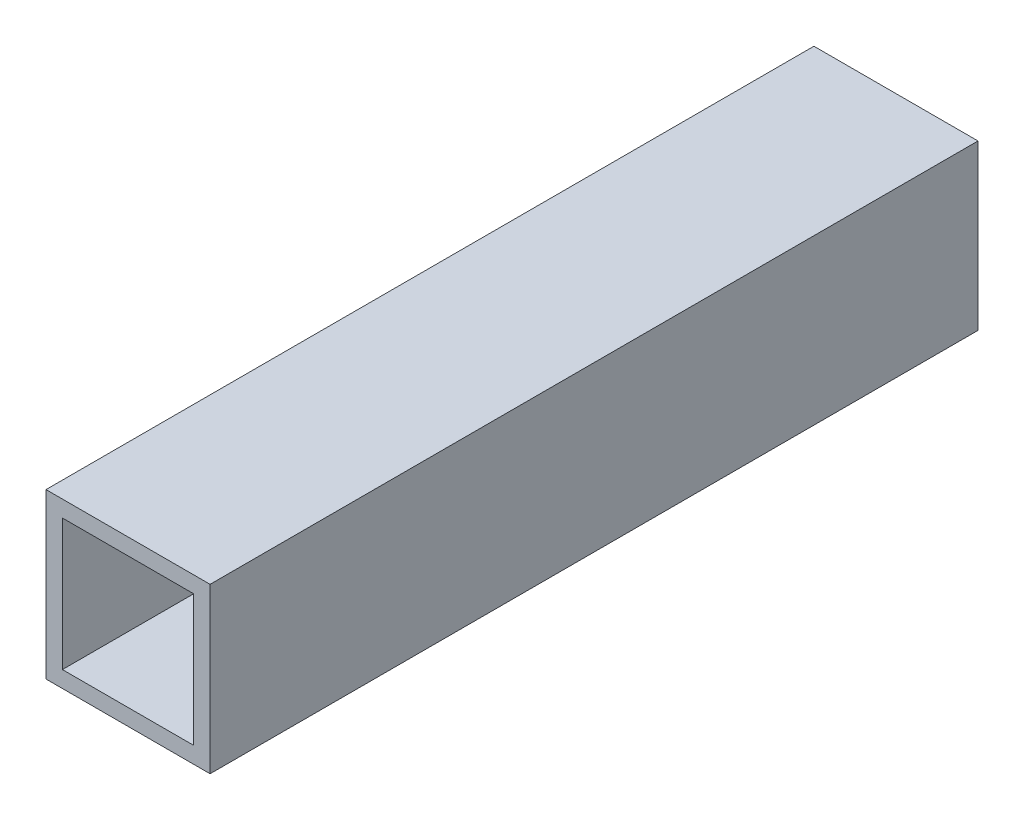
ISO-10303-21;
HEADER;
FILE_DESCRIPTION(('STEP AP214'),'2;1');
FILE_NAME('part.step','',(''),(''),'','','');
FILE_SCHEMA(('AUTOMOTIVE_DESIGN { 1 0 10303 214 1 1 1 1 }'));
ENDSEC;
DATA;
#1=APPLICATION_CONTEXT('core data for automotive mechanical design processes');
#2=APPLICATION_PROTOCOL_DEFINITION('international standard','automotive_design',2000,#1);
#3=PRODUCT_CONTEXT('',#1,'mechanical');
#4=PRODUCT('Part','Part','',(#3));
#5=PRODUCT_RELATED_PRODUCT_CATEGORY('part','',(#4));
#6=PRODUCT_DEFINITION_FORMATION('','',#4);
#7=PRODUCT_DEFINITION_CONTEXT('part definition',#1,'design');
#8=PRODUCT_DEFINITION('design','',#6,#7);
#9=PRODUCT_DEFINITION_SHAPE('','',#8);
#10=(LENGTH_UNIT() NAMED_UNIT(*) SI_UNIT(.MILLI.,.METRE.));
#11=(NAMED_UNIT(*) PLANE_ANGLE_UNIT() SI_UNIT($,.RADIAN.));
#12=(NAMED_UNIT(*) SI_UNIT($,.STERADIAN.) SOLID_ANGLE_UNIT());
#13=UNCERTAINTY_MEASURE_WITH_UNIT(LENGTH_MEASURE(1.E-05),#10,'distance_accuracy_value','');
#14=(GEOMETRIC_REPRESENTATION_CONTEXT(3) GLOBAL_UNCERTAINTY_ASSIGNED_CONTEXT((#13)) GLOBAL_UNIT_ASSIGNED_CONTEXT((#10,
#11,#12)) REPRESENTATION_CONTEXT('',''));
#15=CARTESIAN_POINT('',(0.,0.,0.));
#16=DIRECTION('',(0.,0.,1.));
#17=DIRECTION('',(1.,0.,0.));
#18=AXIS2_PLACEMENT_3D('',#15,#16,#17);
#19=CARTESIAN_POINT('',(0.,0.,468.));
#20=DIRECTION('',(0.,0.,1.));
#21=DIRECTION('',(1.,0.,0.));
#22=AXIS2_PLACEMENT_3D('',#19,#20,#21);
#23=PLANE('',#22);
#24=DIRECTION('',(0.,-1.,0.));
#25=VECTOR('',#24,1.);
#26=CARTESIAN_POINT('',(-40.,40.,468.));
#27=LINE('',#26,#25);
#28=CARTESIAN_POINT('',(-40.,40.,468.));
#29=VERTEX_POINT('',#28);
#30=CARTESIAN_POINT('',(-40.,-40.,468.));
#31=VERTEX_POINT('',#30);
#32=EDGE_CURVE('E24',#29,#31,#27,.T.);
#33=ORIENTED_EDGE('',*,*,#32,.F.);
#34=DIRECTION('',(-1.,0.,0.));
#35=VECTOR('',#34,1.);
#36=CARTESIAN_POINT('',(40.,40.,468.));
#37=LINE('',#36,#35);
#38=CARTESIAN_POINT('',(40.,40.,468.));
#39=VERTEX_POINT('',#38);
#40=EDGE_CURVE('E188',#39,#29,#37,.T.);
#41=ORIENTED_EDGE('',*,*,#40,.F.);
#42=DIRECTION('',(0.,1.,0.));
#43=VECTOR('',#42,1.);
#44=CARTESIAN_POINT('',(40.,-40.,468.));
#45=LINE('',#44,#43);
#46=CARTESIAN_POINT('',(40.,-40.,468.));
#47=VERTEX_POINT('',#46);
#48=EDGE_CURVE('E139',#47,#39,#45,.T.);
#49=ORIENTED_EDGE('',*,*,#48,.F.);
#50=DIRECTION('',(1.,0.,0.));
#51=VECTOR('',#50,1.);
#52=CARTESIAN_POINT('',(-40.,-40.,468.));
#53=LINE('',#52,#51);
#54=EDGE_CURVE('E144',#31,#47,#53,.T.);
#55=ORIENTED_EDGE('',*,*,#54,.F.);
#56=EDGE_LOOP('',(#33,#41,#49,#55));
#57=FACE_BOUND('',#56,.T.);
#58=DIRECTION('',(1.,0.,0.));
#59=VECTOR('',#58,1.);
#60=CARTESIAN_POINT('',(-50.,-50.,468.));
#61=LINE('',#60,#59);
#62=CARTESIAN_POINT('',(-50.,-50.,468.));
#63=VERTEX_POINT('',#62);
#64=CARTESIAN_POINT('',(50.,-50.,468.));
#65=VERTEX_POINT('',#64);
#66=EDGE_CURVE('E120',#63,#65,#61,.T.);
#67=ORIENTED_EDGE('',*,*,#66,.T.);
#68=DIRECTION('',(0.,1.,0.));
#69=VECTOR('',#68,1.);
#70=CARTESIAN_POINT('',(50.,-50.,468.));
#71=LINE('',#70,#69);
#72=CARTESIAN_POINT('',(50.,50.,468.));
#73=VERTEX_POINT('',#72);
#74=EDGE_CURVE('E156',#65,#73,#71,.T.);
#75=ORIENTED_EDGE('',*,*,#74,.T.);
#76=DIRECTION('',(-1.,0.,0.));
#77=VECTOR('',#76,1.);
#78=CARTESIAN_POINT('',(50.,50.,468.));
#79=LINE('',#78,#77);
#80=CARTESIAN_POINT('',(-50.,50.,468.));
#81=VERTEX_POINT('',#80);
#82=EDGE_CURVE('E112',#73,#81,#79,.T.);
#83=ORIENTED_EDGE('',*,*,#82,.T.);
#84=DIRECTION('',(0.,-1.,0.));
#85=VECTOR('',#84,1.);
#86=CARTESIAN_POINT('',(-50.,50.,468.));
#87=LINE('',#86,#85);
#88=EDGE_CURVE('E111',#81,#63,#87,.T.);
#89=ORIENTED_EDGE('',*,*,#88,.T.);
#90=EDGE_LOOP('',(#67,#75,#83,#89));
#91=FACE_BOUND('',#90,.T.);
#92=ADVANCED_FACE('F16',(#57,#91),#23,.T.);
#93=CARTESIAN_POINT('',(0.,0.,0.));
#94=DIRECTION('',(0.,0.,1.));
#95=DIRECTION('',(1.,0.,0.));
#96=AXIS2_PLACEMENT_3D('',#93,#94,#95);
#97=PLANE('',#96);
#98=DIRECTION('',(1.,0.,0.));
#99=VECTOR('',#98,1.);
#100=CARTESIAN_POINT('',(-40.,-40.,0.));
#101=LINE('',#100,#99);
#102=CARTESIAN_POINT('',(-40.,-40.,0.));
#103=VERTEX_POINT('',#102);
#104=CARTESIAN_POINT('',(40.,-40.,0.));
#105=VERTEX_POINT('',#104);
#106=EDGE_CURVE('E137',#103,#105,#101,.T.);
#107=ORIENTED_EDGE('',*,*,#106,.T.);
#108=DIRECTION('',(0.,1.,0.));
#109=VECTOR('',#108,1.);
#110=CARTESIAN_POINT('',(40.,-40.,0.));
#111=LINE('',#110,#109);
#112=CARTESIAN_POINT('',(40.,40.,0.));
#113=VERTEX_POINT('',#112);
#114=EDGE_CURVE('E184',#105,#113,#111,.T.);
#115=ORIENTED_EDGE('',*,*,#114,.T.);
#116=DIRECTION('',(-1.,0.,0.));
#117=VECTOR('',#116,1.);
#118=CARTESIAN_POINT('',(40.,40.,0.));
#119=LINE('',#118,#117);
#120=CARTESIAN_POINT('',(-40.,40.,0.));
#121=VERTEX_POINT('',#120);
#122=EDGE_CURVE('E170',#113,#121,#119,.T.);
#123=ORIENTED_EDGE('',*,*,#122,.T.);
#124=DIRECTION('',(0.,-1.,0.));
#125=VECTOR('',#124,1.);
#126=CARTESIAN_POINT('',(-40.,40.,0.));
#127=LINE('',#126,#125);
#128=EDGE_CURVE('E10',#121,#103,#127,.T.);
#129=ORIENTED_EDGE('',*,*,#128,.T.);
#130=EDGE_LOOP('',(#107,#115,#123,#129));
#131=FACE_BOUND('',#130,.T.);
#132=DIRECTION('',(0.,-1.,0.));
#133=VECTOR('',#132,1.);
#134=CARTESIAN_POINT('',(-50.,50.,0.));
#135=LINE('',#134,#133);
#136=CARTESIAN_POINT('',(-50.,50.,0.));
#137=VERTEX_POINT('',#136);
#138=CARTESIAN_POINT('',(-50.,-50.,0.));
#139=VERTEX_POINT('',#138);
#140=EDGE_CURVE('E100',#137,#139,#135,.T.);
#141=ORIENTED_EDGE('',*,*,#140,.F.);
#142=DIRECTION('',(-1.,0.,0.));
#143=VECTOR('',#142,1.);
#144=CARTESIAN_POINT('',(50.,50.,0.));
#145=LINE('',#144,#143);
#146=CARTESIAN_POINT('',(50.,50.,0.));
#147=VERTEX_POINT('',#146);
#148=EDGE_CURVE('E161',#147,#137,#145,.T.);
#149=ORIENTED_EDGE('',*,*,#148,.F.);
#150=DIRECTION('',(0.,1.,0.));
#151=VECTOR('',#150,1.);
#152=CARTESIAN_POINT('',(50.,-50.,0.));
#153=LINE('',#152,#151);
#154=CARTESIAN_POINT('',(50.,-50.,0.));
#155=VERTEX_POINT('',#154);
#156=EDGE_CURVE('E122',#155,#147,#153,.T.);
#157=ORIENTED_EDGE('',*,*,#156,.F.);
#158=DIRECTION('',(1.,0.,0.));
#159=VECTOR('',#158,1.);
#160=CARTESIAN_POINT('',(-50.,-50.,0.));
#161=LINE('',#160,#159);
#162=EDGE_CURVE('E118',#139,#155,#161,.T.);
#163=ORIENTED_EDGE('',*,*,#162,.F.);
#164=EDGE_LOOP('',(#141,#149,#157,#163));
#165=FACE_BOUND('',#164,.T.);
#166=ADVANCED_FACE('F124',(#131,#165),#97,.F.);
#167=CARTESIAN_POINT('',(-40.,40.,0.));
#168=DIRECTION('',(1.,0.,0.));
#169=DIRECTION('',(0.,1.,0.));
#170=AXIS2_PLACEMENT_3D('',#167,#168,#169);
#171=PLANE('',#170);
#172=DIRECTION('',(0.,0.,1.));
#173=VECTOR('',#172,1.);
#174=CARTESIAN_POINT('',(-40.,40.,0.));
#175=LINE('',#174,#173);
#176=EDGE_CURVE('E173',#121,#29,#175,.T.);
#177=ORIENTED_EDGE('',*,*,#176,.T.);
#178=ORIENTED_EDGE('',*,*,#32,.T.);
#179=DIRECTION('',(0.,0.,1.));
#180=VECTOR('',#179,1.);
#181=CARTESIAN_POINT('',(-40.,-40.,0.));
#182=LINE('',#181,#180);
#183=EDGE_CURVE('E148',#103,#31,#182,.T.);
#184=ORIENTED_EDGE('',*,*,#183,.F.);
#185=ORIENTED_EDGE('',*,*,#128,.F.);
#186=EDGE_LOOP('',(#177,#178,#184,#185));
#187=FACE_BOUND('',#186,.T.);
#188=ADVANCED_FACE('F195',(#187),#171,.T.);
#189=CARTESIAN_POINT('',(40.,40.,0.));
#190=DIRECTION('',(0.,-1.,0.));
#191=DIRECTION('',(0.,0.,-1.));
#192=AXIS2_PLACEMENT_3D('',#189,#190,#191);
#193=PLANE('',#192);
#194=DIRECTION('',(0.,0.,1.));
#195=VECTOR('',#194,1.);
#196=CARTESIAN_POINT('',(40.,40.,0.));
#197=LINE('',#196,#195);
#198=EDGE_CURVE('E180',#113,#39,#197,.T.);
#199=ORIENTED_EDGE('',*,*,#198,.T.);
#200=ORIENTED_EDGE('',*,*,#40,.T.);
#201=ORIENTED_EDGE('',*,*,#176,.F.);
#202=ORIENTED_EDGE('',*,*,#122,.F.);
#203=EDGE_LOOP('',(#199,#200,#201,#202));
#204=FACE_BOUND('',#203,.T.);
#205=ADVANCED_FACE('F205',(#204),#193,.T.);
#206=CARTESIAN_POINT('',(40.,-40.,0.));
#207=DIRECTION('',(-1.,0.,0.));
#208=DIRECTION('',(0.,0.,1.));
#209=AXIS2_PLACEMENT_3D('',#206,#207,#208);
#210=PLANE('',#209);
#211=DIRECTION('',(0.,0.,1.));
#212=VECTOR('',#211,1.);
#213=CARTESIAN_POINT('',(40.,-40.,0.));
#214=LINE('',#213,#212);
#215=EDGE_CURVE('E140',#105,#47,#214,.T.);
#216=ORIENTED_EDGE('',*,*,#215,.T.);
#217=ORIENTED_EDGE('',*,*,#48,.T.);
#218=ORIENTED_EDGE('',*,*,#198,.F.);
#219=ORIENTED_EDGE('',*,*,#114,.F.);
#220=EDGE_LOOP('',(#216,#217,#218,#219));
#221=FACE_BOUND('',#220,.T.);
#222=ADVANCED_FACE('F207',(#221),#210,.T.);
#223=CARTESIAN_POINT('',(-40.,-40.,0.));
#224=DIRECTION('',(0.,1.,0.));
#225=DIRECTION('',(1.,0.,0.));
#226=AXIS2_PLACEMENT_3D('',#223,#224,#225);
#227=PLANE('',#226);
#228=ORIENTED_EDGE('',*,*,#183,.T.);
#229=ORIENTED_EDGE('',*,*,#54,.T.);
#230=ORIENTED_EDGE('',*,*,#215,.F.);
#231=ORIENTED_EDGE('',*,*,#106,.F.);
#232=EDGE_LOOP('',(#228,#229,#230,#231));
#233=FACE_BOUND('',#232,.T.);
#234=ADVANCED_FACE('F201',(#233),#227,.T.);
#235=CARTESIAN_POINT('',(-50.,50.,0.));
#236=DIRECTION('',(1.,0.,0.));
#237=DIRECTION('',(0.,1.,0.));
#238=AXIS2_PLACEMENT_3D('',#235,#236,#237);
#239=PLANE('',#238);
#240=ORIENTED_EDGE('',*,*,#140,.T.);
#241=DIRECTION('',(0.,0.,1.));
#242=VECTOR('',#241,1.);
#243=CARTESIAN_POINT('',(-50.,-50.,0.));
#244=LINE('',#243,#242);
#245=EDGE_CURVE('E103',#139,#63,#244,.T.);
#246=ORIENTED_EDGE('',*,*,#245,.T.);
#247=ORIENTED_EDGE('',*,*,#88,.F.);
#248=DIRECTION('',(0.,0.,1.));
#249=VECTOR('',#248,1.);
#250=CARTESIAN_POINT('',(-50.,50.,0.));
#251=LINE('',#250,#249);
#252=EDGE_CURVE('E106',#137,#81,#251,.T.);
#253=ORIENTED_EDGE('',*,*,#252,.F.);
#254=EDGE_LOOP('',(#240,#246,#247,#253));
#255=FACE_BOUND('',#254,.T.);
#256=ADVANCED_FACE('F102',(#255),#239,.F.);
#257=CARTESIAN_POINT('',(50.,50.,0.));
#258=DIRECTION('',(0.,-1.,0.));
#259=DIRECTION('',(0.,0.,-1.));
#260=AXIS2_PLACEMENT_3D('',#257,#258,#259);
#261=PLANE('',#260);
#262=ORIENTED_EDGE('',*,*,#148,.T.);
#263=ORIENTED_EDGE('',*,*,#252,.T.);
#264=ORIENTED_EDGE('',*,*,#82,.F.);
#265=DIRECTION('',(0.,0.,1.));
#266=VECTOR('',#265,1.);
#267=CARTESIAN_POINT('',(50.,50.,0.));
#268=LINE('',#267,#266);
#269=EDGE_CURVE('E152',#147,#73,#268,.T.);
#270=ORIENTED_EDGE('',*,*,#269,.F.);
#271=EDGE_LOOP('',(#262,#263,#264,#270));
#272=FACE_BOUND('',#271,.T.);
#273=ADVANCED_FACE('F227',(#272),#261,.F.);
#274=CARTESIAN_POINT('',(50.,-50.,0.));
#275=DIRECTION('',(-1.,0.,0.));
#276=DIRECTION('',(0.,0.,1.));
#277=AXIS2_PLACEMENT_3D('',#274,#275,#276);
#278=PLANE('',#277);
#279=ORIENTED_EDGE('',*,*,#156,.T.);
#280=ORIENTED_EDGE('',*,*,#269,.T.);
#281=ORIENTED_EDGE('',*,*,#74,.F.);
#282=DIRECTION('',(0.,0.,1.));
#283=VECTOR('',#282,1.);
#284=CARTESIAN_POINT('',(50.,-50.,0.));
#285=LINE('',#284,#283);
#286=EDGE_CURVE('E128',#155,#65,#285,.T.);
#287=ORIENTED_EDGE('',*,*,#286,.F.);
#288=EDGE_LOOP('',(#279,#280,#281,#287));
#289=FACE_BOUND('',#288,.T.);
#290=ADVANCED_FACE('F232',(#289),#278,.F.);
#291=CARTESIAN_POINT('',(-50.,-50.,0.));
#292=DIRECTION('',(0.,1.,0.));
#293=DIRECTION('',(1.,0.,0.));
#294=AXIS2_PLACEMENT_3D('',#291,#292,#293);
#295=PLANE('',#294);
#296=ORIENTED_EDGE('',*,*,#162,.T.);
#297=ORIENTED_EDGE('',*,*,#286,.T.);
#298=ORIENTED_EDGE('',*,*,#66,.F.);
#299=ORIENTED_EDGE('',*,*,#245,.F.);
#300=EDGE_LOOP('',(#296,#297,#298,#299));
#301=FACE_BOUND('',#300,.T.);
#302=ADVANCED_FACE('F116',(#301),#295,.F.);
#303=CLOSED_SHELL('',(#92,#166,#188,#205,#222,#234,#256,#273,#290,#302));
#304=MANIFOLD_SOLID_BREP('B1',#303);
#305=ADVANCED_BREP_SHAPE_REPRESENTATION('',(#18,#304),#14);
#306=SHAPE_DEFINITION_REPRESENTATION(#9,#305);
ENDSEC;
END-ISO-10303-21;
